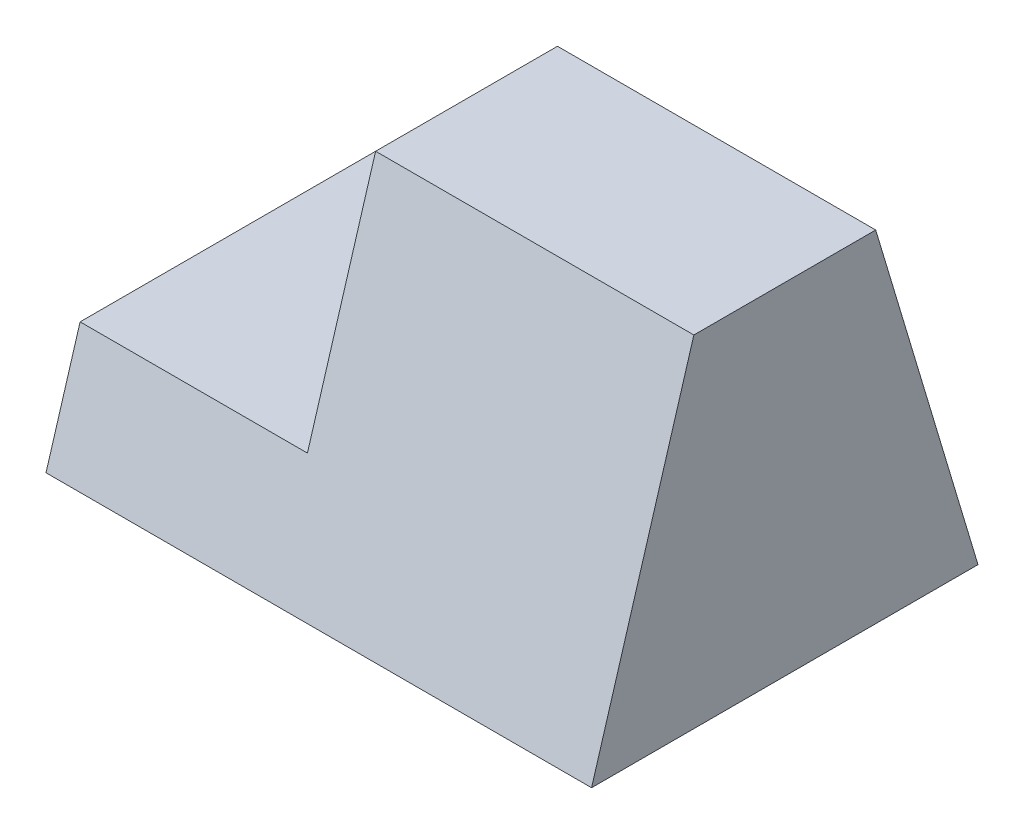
ISO-10303-21;
HEADER;
FILE_DESCRIPTION(('STEP AP214'),'2;1');
FILE_NAME('part.step','',(''),(''),'','','');
FILE_SCHEMA(('AUTOMOTIVE_DESIGN { 1 0 10303 214 1 1 1 1 }'));
ENDSEC;
DATA;
#1=APPLICATION_CONTEXT('core data for automotive mechanical design processes');
#2=APPLICATION_PROTOCOL_DEFINITION('international standard','automotive_design',2000,#1);
#3=PRODUCT_CONTEXT('',#1,'mechanical');
#4=PRODUCT('Part','Part','',(#3));
#5=PRODUCT_RELATED_PRODUCT_CATEGORY('part','',(#4));
#6=PRODUCT_DEFINITION_FORMATION('','',#4);
#7=PRODUCT_DEFINITION_CONTEXT('part definition',#1,'design');
#8=PRODUCT_DEFINITION('design','',#6,#7);
#9=PRODUCT_DEFINITION_SHAPE('','',#8);
#10=(LENGTH_UNIT() NAMED_UNIT(*) SI_UNIT(.MILLI.,.METRE.));
#11=(NAMED_UNIT(*) PLANE_ANGLE_UNIT() SI_UNIT($,.RADIAN.));
#12=(NAMED_UNIT(*) SI_UNIT($,.STERADIAN.) SOLID_ANGLE_UNIT());
#13=UNCERTAINTY_MEASURE_WITH_UNIT(LENGTH_MEASURE(1.E-05),#10,'distance_accuracy_value','');
#14=(GEOMETRIC_REPRESENTATION_CONTEXT(3) GLOBAL_UNCERTAINTY_ASSIGNED_CONTEXT((#13)) GLOBAL_UNIT_ASSIGNED_CONTEXT((#10,
#11,#12)) REPRESENTATION_CONTEXT('',''));
#15=CARTESIAN_POINT('',(0.,0.,0.));
#16=DIRECTION('',(0.,0.,1.));
#17=DIRECTION('',(1.,0.,0.));
#18=AXIS2_PLACEMENT_3D('',#15,#16,#17);
#19=CARTESIAN_POINT('',(120.,75.,-20.));
#20=DIRECTION('',(0.,-1.,0.));
#21=DIRECTION('',(0.,0.,-1.));
#22=AXIS2_PLACEMENT_3D('',#19,#20,#21);
#23=PLANE('',#22);
#24=DIRECTION('',(0.,0.,-1.));
#25=VECTOR('',#24,1.);
#26=CARTESIAN_POINT('',(50.,75.,20.));
#27=LINE('',#26,#25);
#28=CARTESIAN_POINT('',(50.,75.,20.));
#29=VERTEX_POINT('',#28);
#30=CARTESIAN_POINT('',(50.,75.,-20.));
#31=VERTEX_POINT('',#30);
#32=EDGE_CURVE('E91',#29,#31,#27,.T.);
#33=ORIENTED_EDGE('',*,*,#32,.F.);
#34=DIRECTION('',(-1.,0.,0.));
#35=VECTOR('',#34,1.);
#36=CARTESIAN_POINT('',(120.,75.,20.));
#37=LINE('',#36,#35);
#38=CARTESIAN_POINT('',(120.,75.,20.));
#39=VERTEX_POINT('',#38);
#40=EDGE_CURVE('E111',#39,#29,#37,.T.);
#41=ORIENTED_EDGE('',*,*,#40,.F.);
#42=DIRECTION('',(0.,0.,1.));
#43=VECTOR('',#42,1.);
#44=CARTESIAN_POINT('',(120.,75.,-20.));
#45=LINE('',#44,#43);
#46=CARTESIAN_POINT('',(120.,75.,-20.));
#47=VERTEX_POINT('',#46);
#48=EDGE_CURVE('E55',#47,#39,#45,.T.);
#49=ORIENTED_EDGE('',*,*,#48,.F.);
#50=DIRECTION('',(-1.,0.,0.));
#51=VECTOR('',#50,1.);
#52=CARTESIAN_POINT('',(120.,75.,-20.));
#53=LINE('',#52,#51);
#54=EDGE_CURVE('E108',#47,#31,#53,.T.);
#55=ORIENTED_EDGE('',*,*,#54,.T.);
#56=EDGE_LOOP('',(#33,#41,#49,#55));
#57=FACE_BOUND('',#56,.T.);
#58=ADVANCED_FACE('F31',(#57),#23,.F.);
#59=CARTESIAN_POINT('',(120.,75.,20.));
#60=DIRECTION('',(0.,-0.287347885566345,-0.957826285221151));
#61=DIRECTION('',(0.,0.957826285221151,-0.287347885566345));
#62=AXIS2_PLACEMENT_3D('',#59,#60,#61);
#63=PLANE('',#62);
#64=DIRECTION('',(0.,0.957826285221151,-0.287347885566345));
#65=VECTOR('',#64,1.);
#66=CARTESIAN_POINT('',(50.,25.,35.));
#67=LINE('',#66,#65);
#68=CARTESIAN_POINT('',(50.,25.,35.));
#69=VERTEX_POINT('',#68);
#70=EDGE_CURVE('E97',#69,#29,#67,.T.);
#71=ORIENTED_EDGE('',*,*,#70,.F.);
#72=DIRECTION('',(-1.,0.,0.));
#73=VECTOR('',#72,1.);
#74=CARTESIAN_POINT('',(50.,25.,35.));
#75=LINE('',#74,#73);
#76=CARTESIAN_POINT('',(0.,25.,35.));
#77=VERTEX_POINT('',#76);
#78=EDGE_CURVE('E121',#69,#77,#75,.T.);
#79=ORIENTED_EDGE('',*,*,#78,.T.);
#80=DIRECTION('',(0.,-0.957826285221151,0.287347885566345));
#81=VECTOR('',#80,1.);
#82=CARTESIAN_POINT('',(0.,75.,20.));
#83=LINE('',#82,#81);
#84=CARTESIAN_POINT('',(0.,0.,42.5));
#85=VERTEX_POINT('',#84);
#86=EDGE_CURVE('E119',#77,#85,#83,.T.);
#87=ORIENTED_EDGE('',*,*,#86,.T.);
#88=DIRECTION('',(-1.,0.,0.));
#89=VECTOR('',#88,1.);
#90=CARTESIAN_POINT('',(120.,0.,42.5));
#91=LINE('',#90,#89);
#92=CARTESIAN_POINT('',(120.,0.,42.5));
#93=VERTEX_POINT('',#92);
#94=EDGE_CURVE('E11',#93,#85,#91,.T.);
#95=ORIENTED_EDGE('',*,*,#94,.F.);
#96=DIRECTION('',(0.,-0.957826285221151,0.287347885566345));
#97=VECTOR('',#96,1.);
#98=CARTESIAN_POINT('',(120.,75.,20.));
#99=LINE('',#98,#97);
#100=EDGE_CURVE('E117',#39,#93,#99,.T.);
#101=ORIENTED_EDGE('',*,*,#100,.F.);
#102=ORIENTED_EDGE('',*,*,#40,.T.);
#103=EDGE_LOOP('',(#71,#79,#87,#95,#101,#102));
#104=FACE_BOUND('',#103,.T.);
#105=ADVANCED_FACE('F33',(#104),#63,.F.);
#106=CARTESIAN_POINT('',(120.,0.,42.5));
#107=DIRECTION('',(0.,1.,0.));
#108=DIRECTION('',(0.,0.,1.));
#109=AXIS2_PLACEMENT_3D('',#106,#107,#108);
#110=PLANE('',#109);
#111=DIRECTION('',(0.,0.,-1.));
#112=VECTOR('',#111,1.);
#113=CARTESIAN_POINT('',(0.,0.,42.5));
#114=LINE('',#113,#112);
#115=CARTESIAN_POINT('',(0.,0.,-42.5));
#116=VERTEX_POINT('',#115);
#117=EDGE_CURVE('E70',#85,#116,#114,.T.);
#118=ORIENTED_EDGE('',*,*,#117,.T.);
#119=DIRECTION('',(-1.,0.,0.));
#120=VECTOR('',#119,1.);
#121=CARTESIAN_POINT('',(120.,0.,-42.5));
#122=LINE('',#121,#120);
#123=CARTESIAN_POINT('',(120.,0.,-42.5));
#124=VERTEX_POINT('',#123);
#125=EDGE_CURVE('E39',#124,#116,#122,.T.);
#126=ORIENTED_EDGE('',*,*,#125,.F.);
#127=DIRECTION('',(0.,0.,-1.));
#128=VECTOR('',#127,1.);
#129=CARTESIAN_POINT('',(120.,0.,42.5));
#130=LINE('',#129,#128);
#131=EDGE_CURVE('E75',#93,#124,#130,.T.);
#132=ORIENTED_EDGE('',*,*,#131,.F.);
#133=ORIENTED_EDGE('',*,*,#94,.T.);
#134=EDGE_LOOP('',(#118,#126,#132,#133));
#135=FACE_BOUND('',#134,.T.);
#136=ADVANCED_FACE('F137',(#135),#110,.F.);
#137=CARTESIAN_POINT('',(120.,0.,-42.5));
#138=DIRECTION('',(0.,-0.287347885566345,0.957826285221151));
#139=DIRECTION('',(0.,-0.957826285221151,-0.287347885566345));
#140=AXIS2_PLACEMENT_3D('',#137,#138,#139);
#141=PLANE('',#140);
#142=DIRECTION('',(0.,0.957826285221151,0.287347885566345));
#143=VECTOR('',#142,1.);
#144=CARTESIAN_POINT('',(0.,0.,-42.5));
#145=LINE('',#144,#143);
#146=CARTESIAN_POINT('',(0.,25.,-35.));
#147=VERTEX_POINT('',#146);
#148=EDGE_CURVE('E115',#116,#147,#145,.T.);
#149=ORIENTED_EDGE('',*,*,#148,.T.);
#150=DIRECTION('',(-1.,0.,0.));
#151=VECTOR('',#150,1.);
#152=CARTESIAN_POINT('',(50.,25.,-35.));
#153=LINE('',#152,#151);
#154=CARTESIAN_POINT('',(50.,25.,-35.));
#155=VERTEX_POINT('',#154);
#156=EDGE_CURVE('E46',#155,#147,#153,.T.);
#157=ORIENTED_EDGE('',*,*,#156,.F.);
#158=DIRECTION('',(0.,-0.957826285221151,-0.287347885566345));
#159=VECTOR('',#158,1.);
#160=CARTESIAN_POINT('',(50.,75.,-20.));
#161=LINE('',#160,#159);
#162=EDGE_CURVE('E95',#31,#155,#161,.T.);
#163=ORIENTED_EDGE('',*,*,#162,.F.);
#164=ORIENTED_EDGE('',*,*,#54,.F.);
#165=DIRECTION('',(0.,0.957826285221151,0.287347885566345));
#166=VECTOR('',#165,1.);
#167=CARTESIAN_POINT('',(120.,0.,-42.5));
#168=LINE('',#167,#166);
#169=EDGE_CURVE('E123',#124,#47,#168,.T.);
#170=ORIENTED_EDGE('',*,*,#169,.F.);
#171=ORIENTED_EDGE('',*,*,#125,.T.);
#172=EDGE_LOOP('',(#149,#157,#163,#164,#170,#171));
#173=FACE_BOUND('',#172,.T.);
#174=ADVANCED_FACE('F106',(#173),#141,.F.);
#175=CARTESIAN_POINT('',(120.,0.,42.5));
#176=DIRECTION('',(1.,0.,0.));
#177=DIRECTION('',(0.,0.,-1.));
#178=AXIS2_PLACEMENT_3D('',#175,#176,#177);
#179=PLANE('',#178);
#180=ORIENTED_EDGE('',*,*,#100,.T.);
#181=ORIENTED_EDGE('',*,*,#131,.T.);
#182=ORIENTED_EDGE('',*,*,#169,.T.);
#183=ORIENTED_EDGE('',*,*,#48,.T.);
#184=EDGE_LOOP('',(#180,#181,#182,#183));
#185=FACE_BOUND('',#184,.T.);
#186=ADVANCED_FACE('F136',(#185),#179,.T.);
#187=CARTESIAN_POINT('',(0.,0.,42.5));
#188=DIRECTION('',(1.,0.,0.));
#189=DIRECTION('',(0.,0.,-1.));
#190=AXIS2_PLACEMENT_3D('',#187,#188,#189);
#191=PLANE('',#190);
#192=ORIENTED_EDGE('',*,*,#86,.F.);
#193=DIRECTION('',(0.,0.,1.));
#194=VECTOR('',#193,1.);
#195=CARTESIAN_POINT('',(0.,25.,-35.));
#196=LINE('',#195,#194);
#197=EDGE_CURVE('E101',#147,#77,#196,.T.);
#198=ORIENTED_EDGE('',*,*,#197,.F.);
#199=ORIENTED_EDGE('',*,*,#148,.F.);
#200=ORIENTED_EDGE('',*,*,#117,.F.);
#201=EDGE_LOOP('',(#192,#198,#199,#200));
#202=FACE_BOUND('',#201,.T.);
#203=ADVANCED_FACE('F140',(#202),#191,.F.);
#204=CARTESIAN_POINT('',(50.,25.,-35.));
#205=DIRECTION('',(0.,-1.,0.));
#206=DIRECTION('',(0.,0.,-1.));
#207=AXIS2_PLACEMENT_3D('',#204,#205,#206);
#208=PLANE('',#207);
#209=ORIENTED_EDGE('',*,*,#197,.T.);
#210=ORIENTED_EDGE('',*,*,#78,.F.);
#211=DIRECTION('',(0.,0.,1.));
#212=VECTOR('',#211,1.);
#213=CARTESIAN_POINT('',(50.,25.,-35.));
#214=LINE('',#213,#212);
#215=EDGE_CURVE('E109',#155,#69,#214,.T.);
#216=ORIENTED_EDGE('',*,*,#215,.F.);
#217=ORIENTED_EDGE('',*,*,#156,.T.);
#218=EDGE_LOOP('',(#209,#210,#216,#217));
#219=FACE_BOUND('',#218,.T.);
#220=ADVANCED_FACE('F141',(#219),#208,.F.);
#221=CARTESIAN_POINT('',(50.,75.,-20.));
#222=DIRECTION('',(-1.,0.,0.));
#223=DIRECTION('',(0.,0.,1.));
#224=AXIS2_PLACEMENT_3D('',#221,#222,#223);
#225=PLANE('',#224);
#226=ORIENTED_EDGE('',*,*,#32,.T.);
#227=ORIENTED_EDGE('',*,*,#162,.T.);
#228=ORIENTED_EDGE('',*,*,#215,.T.);
#229=ORIENTED_EDGE('',*,*,#70,.T.);
#230=EDGE_LOOP('',(#226,#227,#228,#229));
#231=FACE_BOUND('',#230,.T.);
#232=ADVANCED_FACE('F93',(#231),#225,.T.);
#233=CLOSED_SHELL('',(#58,#105,#136,#174,#186,#203,#220,#232));
#234=MANIFOLD_SOLID_BREP('B2',#233);
#235=ADVANCED_BREP_SHAPE_REPRESENTATION('',(#18,#234),#14);
#236=SHAPE_DEFINITION_REPRESENTATION(#9,#235);
ENDSEC;
END-ISO-10303-21;
